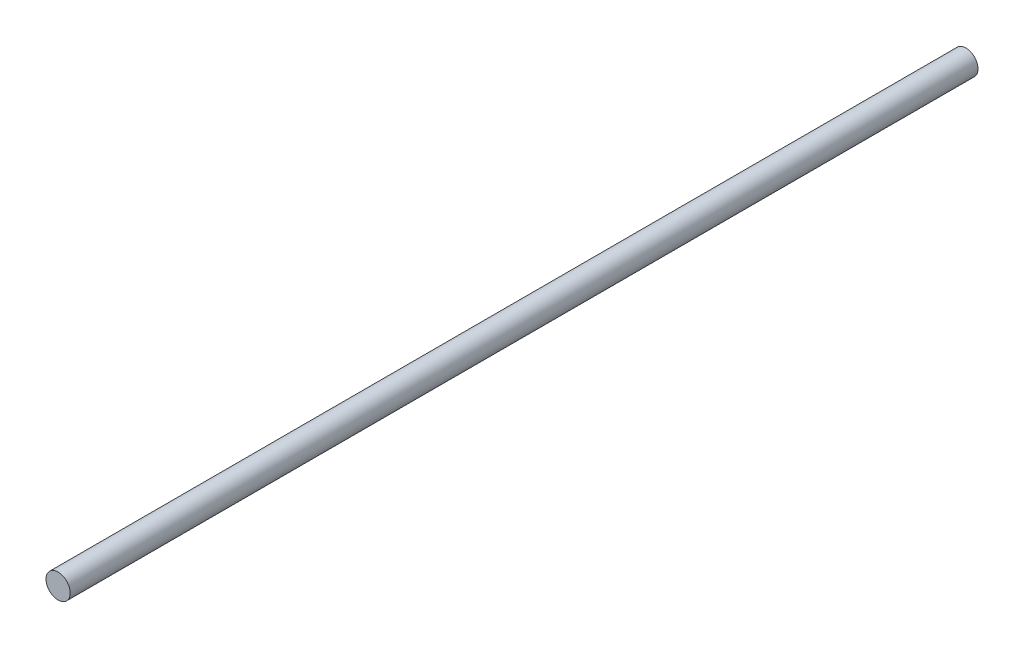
from build123d import *

# Parameters (mm, degrees)
SKETCH1_R           = 4
BOSS_EXTRUDE1_DEPTH = 150


with BuildPart() as part:
    # Sketch1 → Boss-Extrude1 (new, symmetric)
    with BuildSketch(Plane.XY):
        Circle(SKETCH1_R)
    extrude(amount=BOSS_EXTRUDE1_DEPTH, both=True)


solid = part.part
